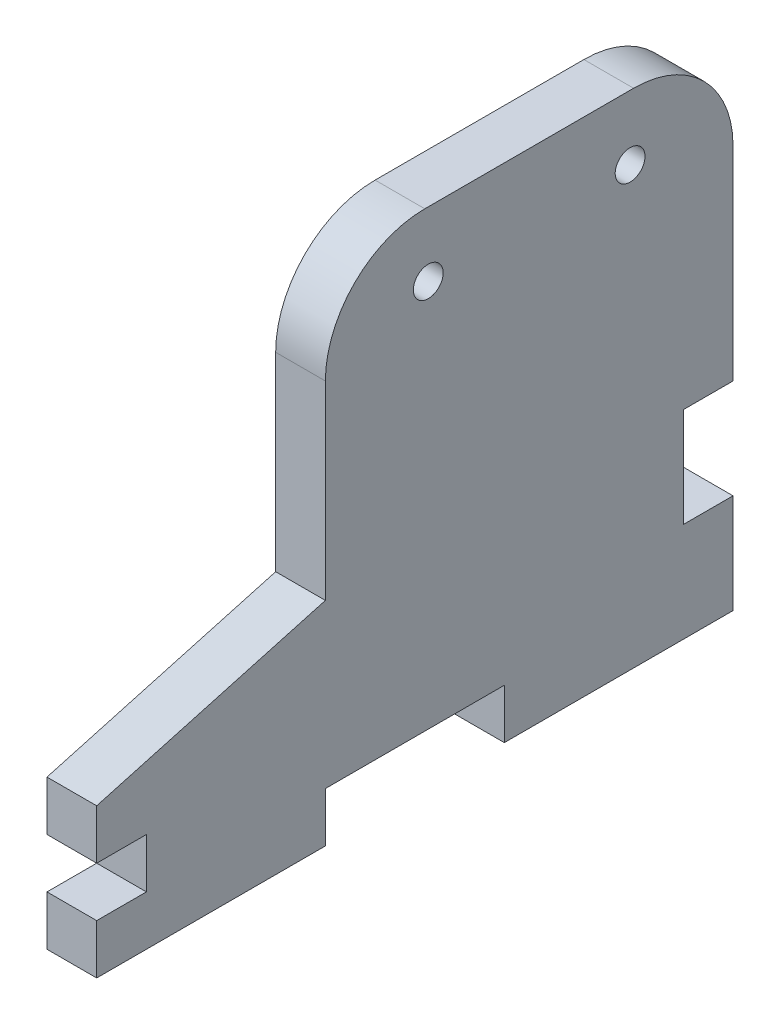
ISO-10303-21;
HEADER;
FILE_DESCRIPTION(('STEP AP214'),'2;1');
FILE_NAME('part.step','',(''),(''),'','','');
FILE_SCHEMA(('AUTOMOTIVE_DESIGN { 1 0 10303 214 1 1 1 1 }'));
ENDSEC;
DATA;
#1=APPLICATION_CONTEXT('core data for automotive mechanical design processes');
#2=APPLICATION_PROTOCOL_DEFINITION('international standard','automotive_design',2000,#1);
#3=PRODUCT_CONTEXT('',#1,'mechanical');
#4=PRODUCT('Part','Part','',(#3));
#5=PRODUCT_RELATED_PRODUCT_CATEGORY('part','',(#4));
#6=PRODUCT_DEFINITION_FORMATION('','',#4);
#7=PRODUCT_DEFINITION_CONTEXT('part definition',#1,'design');
#8=PRODUCT_DEFINITION('design','',#6,#7);
#9=PRODUCT_DEFINITION_SHAPE('','',#8);
#10=(LENGTH_UNIT() NAMED_UNIT(*) SI_UNIT(.MILLI.,.METRE.));
#11=(NAMED_UNIT(*) PLANE_ANGLE_UNIT() SI_UNIT($,.RADIAN.));
#12=(NAMED_UNIT(*) SI_UNIT($,.STERADIAN.) SOLID_ANGLE_UNIT());
#13=UNCERTAINTY_MEASURE_WITH_UNIT(LENGTH_MEASURE(1.E-05),#10,'distance_accuracy_value','');
#14=(GEOMETRIC_REPRESENTATION_CONTEXT(3) GLOBAL_UNCERTAINTY_ASSIGNED_CONTEXT((#13)) GLOBAL_UNIT_ASSIGNED_CONTEXT((#10,
#11,#12)) REPRESENTATION_CONTEXT('',''));
#15=CARTESIAN_POINT('',(0.,0.,0.));
#16=DIRECTION('',(0.,0.,1.));
#17=DIRECTION('',(1.,0.,0.));
#18=AXIS2_PLACEMENT_3D('',#15,#16,#17);
#19=CARTESIAN_POINT('',(5.,5.,19.6666666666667));
#20=DIRECTION('',(0.,0.,-1.));
#21=DIRECTION('',(0.,1.,0.));
#22=AXIS2_PLACEMENT_3D('',#19,#20,#21);
#23=PLANE('',#22);
#24=DIRECTION('',(0.,-1.,0.));
#25=VECTOR('',#24,1.);
#26=CARTESIAN_POINT('',(0.,5.,19.6666666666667));
#27=LINE('',#26,#25);
#28=CARTESIAN_POINT('',(0.,5.,19.6666666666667));
#29=VERTEX_POINT('',#28);
#30=CARTESIAN_POINT('',(0.,0.,19.6666666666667));
#31=VERTEX_POINT('',#30);
#32=EDGE_CURVE('E215',#29,#31,#27,.T.);
#33=ORIENTED_EDGE('',*,*,#32,.T.);
#34=DIRECTION('',(1.,0.,0.));
#35=VECTOR('',#34,1.);
#36=CARTESIAN_POINT('',(0.,0.,19.6666666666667));
#37=LINE('',#36,#35);
#38=CARTESIAN_POINT('',(5.,0.,19.6666666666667));
#39=VERTEX_POINT('',#38);
#40=EDGE_CURVE('E271',#31,#39,#37,.T.);
#41=ORIENTED_EDGE('',*,*,#40,.T.);
#42=DIRECTION('',(0.,-1.,0.));
#43=VECTOR('',#42,1.);
#44=CARTESIAN_POINT('',(5.,5.,19.6666666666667));
#45=LINE('',#44,#43);
#46=CARTESIAN_POINT('',(5.,5.,19.6666666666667));
#47=VERTEX_POINT('',#46);
#48=EDGE_CURVE('E198',#47,#39,#45,.T.);
#49=ORIENTED_EDGE('',*,*,#48,.F.);
#50=DIRECTION('',(-1.,0.,0.));
#51=VECTOR('',#50,1.);
#52=CARTESIAN_POINT('',(5.,5.,19.6666666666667));
#53=LINE('',#52,#51);
#54=EDGE_CURVE('E193',#47,#29,#53,.T.);
#55=ORIENTED_EDGE('',*,*,#54,.T.);
#56=EDGE_LOOP('',(#33,#41,#49,#55));
#57=FACE_BOUND('',#56,.T.);
#58=ADVANCED_FACE('F34',(#57),#23,.F.);
#59=CARTESIAN_POINT('',(5.,-10.,19.6666666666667));
#60=DIRECTION('',(0.,1.,0.));
#61=DIRECTION('',(0.,0.,1.));
#62=AXIS2_PLACEMENT_3D('',#59,#60,#61);
#63=PLANE('',#62);
#64=DIRECTION('',(0.,0.,-1.));
#65=VECTOR('',#64,1.);
#66=CARTESIAN_POINT('',(0.,-10.,19.6666666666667));
#67=LINE('',#66,#65);
#68=CARTESIAN_POINT('',(0.,-10.,19.6666666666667));
#69=VERTEX_POINT('',#68);
#70=CARTESIAN_POINT('',(0.,-10.,-3.33333333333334));
#71=VERTEX_POINT('',#70);
#72=EDGE_CURVE('E200',#69,#71,#67,.T.);
#73=ORIENTED_EDGE('',*,*,#72,.T.);
#74=DIRECTION('',(1.,0.,0.));
#75=VECTOR('',#74,1.);
#76=CARTESIAN_POINT('',(0.,-10.,-3.33333333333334));
#77=LINE('',#76,#75);
#78=CARTESIAN_POINT('',(5.,-10.,-3.33333333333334));
#79=VERTEX_POINT('',#78);
#80=EDGE_CURVE('E277',#71,#79,#77,.T.);
#81=ORIENTED_EDGE('',*,*,#80,.T.);
#82=DIRECTION('',(0.,0.,-1.));
#83=VECTOR('',#82,1.);
#84=CARTESIAN_POINT('',(5.,-10.,19.6666666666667));
#85=LINE('',#84,#83);
#86=CARTESIAN_POINT('',(5.,-10.,19.6666666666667));
#87=VERTEX_POINT('',#86);
#88=EDGE_CURVE('E205',#87,#79,#85,.T.);
#89=ORIENTED_EDGE('',*,*,#88,.F.);
#90=DIRECTION('',(-1.,0.,0.));
#91=VECTOR('',#90,1.);
#92=CARTESIAN_POINT('',(5.,-10.,19.6666666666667));
#93=LINE('',#92,#91);
#94=EDGE_CURVE('E208',#87,#69,#93,.T.);
#95=ORIENTED_EDGE('',*,*,#94,.T.);
#96=EDGE_LOOP('',(#73,#81,#89,#95));
#97=FACE_BOUND('',#96,.T.);
#98=ADVANCED_FACE('F379',(#97),#63,.F.);
#99=CARTESIAN_POINT('',(5.,20.,-39.3333333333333));
#100=DIRECTION('',(0.,0.,1.));
#101=DIRECTION('',(1.,0.,0.));
#102=AXIS2_PLACEMENT_3D('',#99,#100,#101);
#103=PLANE('',#102);
#104=DIRECTION('',(0.,1.,0.));
#105=VECTOR('',#104,1.);
#106=CARTESIAN_POINT('',(5.,20.,-39.3333333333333));
#107=LINE('',#106,#105);
#108=CARTESIAN_POINT('',(5.,0.,-39.3333333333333));
#109=VERTEX_POINT('',#108);
#110=CARTESIAN_POINT('',(5.,10.,-39.3333333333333));
#111=VERTEX_POINT('',#110);
#112=EDGE_CURVE('E196',#109,#111,#107,.T.);
#113=ORIENTED_EDGE('',*,*,#112,.F.);
#114=DIRECTION('',(1.,0.,0.));
#115=VECTOR('',#114,1.);
#116=CARTESIAN_POINT('',(-11.180339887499,0.,-39.3333333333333));
#117=LINE('',#116,#115);
#118=CARTESIAN_POINT('',(0.,0.,-39.3333333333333));
#119=VERTEX_POINT('',#118);
#120=EDGE_CURVE('E333',#119,#109,#117,.T.);
#121=ORIENTED_EDGE('',*,*,#120,.F.);
#122=DIRECTION('',(0.,1.,0.));
#123=VECTOR('',#122,1.);
#124=CARTESIAN_POINT('',(0.,20.,-39.3333333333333));
#125=LINE('',#124,#123);
#126=CARTESIAN_POINT('',(0.,10.,-39.3333333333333));
#127=VERTEX_POINT('',#126);
#128=EDGE_CURVE('E209',#119,#127,#125,.T.);
#129=ORIENTED_EDGE('',*,*,#128,.T.);
#130=DIRECTION('',(1.,0.,0.));
#131=VECTOR('',#130,1.);
#132=CARTESIAN_POINT('',(-11.180339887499,10.,-39.3333333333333));
#133=LINE('',#132,#131);
#134=EDGE_CURVE('E341',#127,#111,#133,.T.);
#135=ORIENTED_EDGE('',*,*,#134,.T.);
#136=EDGE_LOOP('',(#113,#121,#129,#135));
#137=FACE_BOUND('',#136,.T.);
#138=ADVANCED_FACE('F350',(#137),#103,.F.);
#139=CARTESIAN_POINT('',(5.,5.,19.6666666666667));
#140=DIRECTION('',(0.,-0.963517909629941,-0.267643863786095));
#141=DIRECTION('',(0.,0.267643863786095,-0.963517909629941));
#142=AXIS2_PLACEMENT_3D('',#139,#140,#141);
#143=PLANE('',#142);
#144=DIRECTION('',(0.,-0.267643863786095,0.963517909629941));
#145=VECTOR('',#144,1.);
#146=CARTESIAN_POINT('',(5.,5.,19.6666666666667));
#147=LINE('',#146,#145);
#148=CARTESIAN_POINT('',(5.,11.3888888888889,-3.33333333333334));
#149=VERTEX_POINT('',#148);
#150=EDGE_CURVE('E177',#149,#47,#147,.T.);
#151=ORIENTED_EDGE('',*,*,#150,.F.);
#152=DIRECTION('',(1.,0.,0.));
#153=VECTOR('',#152,1.);
#154=CARTESIAN_POINT('',(-50.2837626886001,11.3888888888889,-3.33333333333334));
#155=LINE('',#154,#153);
#156=CARTESIAN_POINT('',(0.,11.3888888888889,-3.33333333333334));
#157=VERTEX_POINT('',#156);
#158=EDGE_CURVE('E181',#157,#149,#155,.T.);
#159=ORIENTED_EDGE('',*,*,#158,.F.);
#160=DIRECTION('',(0.,-0.267643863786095,0.963517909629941));
#161=VECTOR('',#160,1.);
#162=CARTESIAN_POINT('',(0.,5.,19.6666666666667));
#163=LINE('',#162,#161);
#164=EDGE_CURVE('E211',#157,#29,#163,.T.);
#165=ORIENTED_EDGE('',*,*,#164,.T.);
#166=ORIENTED_EDGE('',*,*,#54,.F.);
#167=EDGE_LOOP('',(#151,#159,#165,#166));
#168=FACE_BOUND('',#167,.T.);
#169=ADVANCED_FACE('F191',(#168),#143,.F.);
#170=CARTESIAN_POINT('',(5.,-5.,19.6666666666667));
#171=VERTEX_POINT('',#170);
#172=EDGE_CURVE('E195',#171,#87,#45,.T.);
#173=ORIENTED_EDGE('',*,*,#172,.F.);
#174=DIRECTION('',(1.,0.,0.));
#175=VECTOR('',#174,1.);
#176=CARTESIAN_POINT('',(0.,-5.,19.6666666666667));
#177=LINE('',#176,#175);
#178=CARTESIAN_POINT('',(0.,-5.,19.6666666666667));
#179=VERTEX_POINT('',#178);
#180=EDGE_CURVE('E298',#179,#171,#177,.T.);
#181=ORIENTED_EDGE('',*,*,#180,.F.);
#182=EDGE_CURVE('E214',#179,#69,#27,.T.);
#183=ORIENTED_EDGE('',*,*,#182,.T.);
#184=ORIENTED_EDGE('',*,*,#94,.F.);
#185=EDGE_LOOP('',(#173,#181,#183,#184));
#186=FACE_BOUND('',#185,.T.);
#187=ADVANCED_FACE('F386',(#186),#23,.F.);
#188=CARTESIAN_POINT('',(5.,-10.,-21.3333333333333));
#189=VERTEX_POINT('',#188);
#190=CARTESIAN_POINT('',(5.,-10.,-44.3333333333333));
#191=VERTEX_POINT('',#190);
#192=EDGE_CURVE('E204',#189,#191,#85,.T.);
#193=ORIENTED_EDGE('',*,*,#192,.F.);
#194=DIRECTION('',(1.,0.,0.));
#195=VECTOR('',#194,1.);
#196=CARTESIAN_POINT('',(0.,-10.,-21.3333333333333));
#197=LINE('',#196,#195);
#198=CARTESIAN_POINT('',(0.,-10.,-21.3333333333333));
#199=VERTEX_POINT('',#198);
#200=EDGE_CURVE('E285',#199,#189,#197,.T.);
#201=ORIENTED_EDGE('',*,*,#200,.F.);
#202=CARTESIAN_POINT('',(0.,-10.,-44.3333333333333));
#203=VERTEX_POINT('',#202);
#204=EDGE_CURVE('E218',#199,#203,#67,.T.);
#205=ORIENTED_EDGE('',*,*,#204,.T.);
#206=DIRECTION('',(1.,0.,0.));
#207=VECTOR('',#206,1.);
#208=CARTESIAN_POINT('',(-11.180339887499,-10.,-44.3333333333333));
#209=LINE('',#208,#207);
#210=EDGE_CURVE('E324',#203,#191,#209,.T.);
#211=ORIENTED_EDGE('',*,*,#210,.T.);
#212=EDGE_LOOP('',(#193,#201,#205,#211));
#213=FACE_BOUND('',#212,.T.);
#214=ADVANCED_FACE('F364',(#213),#63,.F.);
#215=CARTESIAN_POINT('',(5.,0.,0.));
#216=DIRECTION('',(1.,0.,0.));
#217=DIRECTION('',(0.,0.,-1.));
#218=AXIS2_PLACEMENT_3D('',#215,#216,#217);
#219=PLANE('',#218);
#220=DIRECTION('',(0.,1.,0.));
#221=VECTOR('',#220,1.);
#222=CARTESIAN_POINT('',(5.,20.,-44.3333333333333));
#223=LINE('',#222,#221);
#224=CARTESIAN_POINT('',(5.,10.,-44.3333333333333));
#225=VERTEX_POINT('',#224);
#226=CARTESIAN_POINT('',(5.,30.5,-44.3333333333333));
#227=VERTEX_POINT('',#226);
#228=EDGE_CURVE('E253',#225,#227,#223,.T.);
#229=ORIENTED_EDGE('',*,*,#228,.T.);
#230=CARTESIAN_POINT('',(5.,30.5,-34.3333333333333));
#231=DIRECTION('',(1.,0.,0.));
#232=DIRECTION('',(0.,0.,-1.));
#233=AXIS2_PLACEMENT_3D('',#230,#231,#232);
#234=CIRCLE('',#233,10.);
#235=CARTESIAN_POINT('',(5.,40.5,-34.3333333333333));
#236=VERTEX_POINT('',#235);
#237=EDGE_CURVE('E228',#227,#236,#234,.T.);
#238=ORIENTED_EDGE('',*,*,#237,.T.);
#239=DIRECTION('',(0.,0.,1.));
#240=VECTOR('',#239,1.);
#241=CARTESIAN_POINT('',(5.,40.5,-3.33333333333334));
#242=LINE('',#241,#240);
#243=CARTESIAN_POINT('',(5.,40.5,-13.3333333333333));
#244=VERTEX_POINT('',#243);
#245=EDGE_CURVE('E182',#236,#244,#242,.T.);
#246=ORIENTED_EDGE('',*,*,#245,.T.);
#247=CARTESIAN_POINT('',(5.,30.5,-13.3333333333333));
#248=DIRECTION('',(1.,0.,0.));
#249=DIRECTION('',(0.,0.,-1.));
#250=AXIS2_PLACEMENT_3D('',#247,#248,#249);
#251=CIRCLE('',#250,10.);
#252=CARTESIAN_POINT('',(5.,30.5,-3.33333333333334));
#253=VERTEX_POINT('',#252);
#254=EDGE_CURVE('E180',#244,#253,#251,.T.);
#255=ORIENTED_EDGE('',*,*,#254,.T.);
#256=DIRECTION('',(0.,-1.,0.));
#257=VECTOR('',#256,1.);
#258=CARTESIAN_POINT('',(5.,11.3888888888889,-3.33333333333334));
#259=LINE('',#258,#257);
#260=EDGE_CURVE('E170',#253,#149,#259,.T.);
#261=ORIENTED_EDGE('',*,*,#260,.T.);
#262=ORIENTED_EDGE('',*,*,#150,.T.);
#263=ORIENTED_EDGE('',*,*,#48,.T.);
#264=DIRECTION('',(0.,0.,1.));
#265=VECTOR('',#264,1.);
#266=CARTESIAN_POINT('',(5.,0.,0.));
#267=LINE('',#266,#265);
#268=CARTESIAN_POINT('',(5.,0.,14.6666666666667));
#269=VERTEX_POINT('',#268);
#270=EDGE_CURVE('E311',#269,#39,#267,.T.);
#271=ORIENTED_EDGE('',*,*,#270,.F.);
#272=DIRECTION('',(0.,1.,0.));
#273=VECTOR('',#272,1.);
#274=CARTESIAN_POINT('',(5.,0.,14.6666666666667));
#275=LINE('',#274,#273);
#276=CARTESIAN_POINT('',(5.,-5.,14.6666666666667));
#277=VERTEX_POINT('',#276);
#278=EDGE_CURVE('E309',#277,#269,#275,.T.);
#279=ORIENTED_EDGE('',*,*,#278,.F.);
#280=DIRECTION('',(0.,0.,-1.));
#281=VECTOR('',#280,1.);
#282=CARTESIAN_POINT('',(5.,-5.,0.));
#283=LINE('',#282,#281);
#284=EDGE_CURVE('E281',#171,#277,#283,.T.);
#285=ORIENTED_EDGE('',*,*,#284,.F.);
#286=ORIENTED_EDGE('',*,*,#172,.T.);
#287=ORIENTED_EDGE('',*,*,#88,.T.);
#288=DIRECTION('',(0.,-1.,0.));
#289=VECTOR('',#288,1.);
#290=CARTESIAN_POINT('',(5.,0.,-3.33333333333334));
#291=LINE('',#290,#289);
#292=CARTESIAN_POINT('',(5.,-4.99999999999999,-3.33333333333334));
#293=VERTEX_POINT('',#292);
#294=EDGE_CURVE('E317',#293,#79,#291,.T.);
#295=ORIENTED_EDGE('',*,*,#294,.F.);
#296=DIRECTION('',(0.,0.,1.));
#297=VECTOR('',#296,1.);
#298=CARTESIAN_POINT('',(5.,-4.99999999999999,0.));
#299=LINE('',#298,#297);
#300=CARTESIAN_POINT('',(5.,-4.99999999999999,-21.3333333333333));
#301=VERTEX_POINT('',#300);
#302=EDGE_CURVE('E315',#301,#293,#299,.T.);
#303=ORIENTED_EDGE('',*,*,#302,.F.);
#304=DIRECTION('',(0.,1.,0.));
#305=VECTOR('',#304,1.);
#306=CARTESIAN_POINT('',(5.,0.,-21.3333333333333));
#307=LINE('',#306,#305);
#308=EDGE_CURVE('E313',#189,#301,#307,.T.);
#309=ORIENTED_EDGE('',*,*,#308,.F.);
#310=ORIENTED_EDGE('',*,*,#192,.T.);
#311=DIRECTION('',(0.,1.,0.));
#312=VECTOR('',#311,1.);
#313=CARTESIAN_POINT('',(5.,0.,-44.3333333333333));
#314=LINE('',#313,#312);
#315=CARTESIAN_POINT('',(5.,0.,-44.3333333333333));
#316=VERTEX_POINT('',#315);
#317=EDGE_CURVE('E319',#191,#316,#314,.T.);
#318=ORIENTED_EDGE('',*,*,#317,.T.);
#319=DIRECTION('',(0.,0.,1.));
#320=VECTOR('',#319,1.);
#321=CARTESIAN_POINT('',(5.,0.,-39.3333333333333));
#322=LINE('',#321,#320);
#323=EDGE_CURVE('E327',#316,#109,#322,.T.);
#324=ORIENTED_EDGE('',*,*,#323,.T.);
#325=ORIENTED_EDGE('',*,*,#112,.T.);
#326=DIRECTION('',(0.,0.,-1.));
#327=VECTOR('',#326,1.);
#328=CARTESIAN_POINT('',(5.,10.,-39.3333333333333));
#329=LINE('',#328,#327);
#330=EDGE_CURVE('E337',#111,#225,#329,.T.);
#331=ORIENTED_EDGE('',*,*,#330,.T.);
#332=EDGE_LOOP('',(#229,#238,#246,#255,#261,#262,#263,#271,#279,#285,#286,#287,#295,#303,#309,
#310,#318,#324,#325,#331));
#333=FACE_BOUND('',#332,.T.);
#334=CARTESIAN_POINT('',(5.,34.,-33.9833333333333));
#335=DIRECTION('',(1.,0.,0.));
#336=DIRECTION('',(0.,0.,-1.));
#337=AXIS2_PLACEMENT_3D('',#334,#335,#336);
#338=CIRCLE('',#337,1.5);
#339=CARTESIAN_POINT('',(5.,34.,-35.4833333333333));
#340=VERTEX_POINT('',#339);
#341=EDGE_CURVE('E259',#340,#340,#338,.T.);
#342=ORIENTED_EDGE('',*,*,#341,.F.);
#343=EDGE_LOOP('',(#342));
#344=FACE_BOUND('',#343,.T.);
#345=CARTESIAN_POINT('',(5.,34.,-13.6833333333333));
#346=DIRECTION('',(1.,0.,0.));
#347=DIRECTION('',(0.,0.,-1.));
#348=AXIS2_PLACEMENT_3D('',#345,#346,#347);
#349=CIRCLE('',#348,1.5);
#350=CARTESIAN_POINT('',(5.,34.,-15.1833333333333));
#351=VERTEX_POINT('',#350);
#352=EDGE_CURVE('E256',#351,#351,#349,.T.);
#353=ORIENTED_EDGE('',*,*,#352,.F.);
#354=EDGE_LOOP('',(#353));
#355=FACE_BOUND('',#354,.T.);
#356=ADVANCED_FACE('F173',(#333,#344,#355),#219,.T.);
#357=CARTESIAN_POINT('',(0.,0.,0.));
#358=DIRECTION('',(1.,0.,0.));
#359=DIRECTION('',(0.,0.,-1.));
#360=AXIS2_PLACEMENT_3D('',#357,#358,#359);
#361=PLANE('',#360);
#362=DIRECTION('',(0.,0.,-1.));
#363=VECTOR('',#362,1.);
#364=CARTESIAN_POINT('',(0.,40.5,-3.33333333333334));
#365=LINE('',#364,#363);
#366=CARTESIAN_POINT('',(0.,40.5,-13.3333333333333));
#367=VERTEX_POINT('',#366);
#368=CARTESIAN_POINT('',(0.,40.5,-34.3333333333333));
#369=VERTEX_POINT('',#368);
#370=EDGE_CURVE('E189',#367,#369,#365,.T.);
#371=ORIENTED_EDGE('',*,*,#370,.T.);
#372=CARTESIAN_POINT('',(0.,30.5,-34.3333333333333));
#373=DIRECTION('',(1.,0.,0.));
#374=DIRECTION('',(0.,0.,-1.));
#375=AXIS2_PLACEMENT_3D('',#372,#373,#374);
#376=CIRCLE('',#375,10.);
#377=CARTESIAN_POINT('',(0.,30.5,-44.3333333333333));
#378=VERTEX_POINT('',#377);
#379=EDGE_CURVE('E42',#369,#378,#376,.F.);
#380=ORIENTED_EDGE('',*,*,#379,.T.);
#381=DIRECTION('',(0.,-1.,0.));
#382=VECTOR('',#381,1.);
#383=CARTESIAN_POINT('',(0.,20.,-44.3333333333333));
#384=LINE('',#383,#382);
#385=CARTESIAN_POINT('',(0.,10.,-44.3333333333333));
#386=VERTEX_POINT('',#385);
#387=EDGE_CURVE('E241',#378,#386,#384,.T.);
#388=ORIENTED_EDGE('',*,*,#387,.T.);
#389=DIRECTION('',(0.,0.,1.));
#390=VECTOR('',#389,1.);
#391=CARTESIAN_POINT('',(0.,10.,-39.3333333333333));
#392=LINE('',#391,#390);
#393=EDGE_CURVE('E212',#386,#127,#392,.T.);
#394=ORIENTED_EDGE('',*,*,#393,.T.);
#395=ORIENTED_EDGE('',*,*,#128,.F.);
#396=DIRECTION('',(0.,0.,-1.));
#397=VECTOR('',#396,1.);
#398=CARTESIAN_POINT('',(0.,0.,-39.3333333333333));
#399=LINE('',#398,#397);
#400=CARTESIAN_POINT('',(0.,0.,-44.3333333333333));
#401=VERTEX_POINT('',#400);
#402=EDGE_CURVE('E323',#119,#401,#399,.T.);
#403=ORIENTED_EDGE('',*,*,#402,.T.);
#404=DIRECTION('',(0.,-1.,0.));
#405=VECTOR('',#404,1.);
#406=CARTESIAN_POINT('',(0.,0.,-44.3333333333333));
#407=LINE('',#406,#405);
#408=EDGE_CURVE('E320',#401,#203,#407,.T.);
#409=ORIENTED_EDGE('',*,*,#408,.T.);
#410=ORIENTED_EDGE('',*,*,#204,.F.);
#411=DIRECTION('',(0.,1.,0.));
#412=VECTOR('',#411,1.);
#413=CARTESIAN_POINT('',(0.,-10.,-21.3333333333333));
#414=LINE('',#413,#412);
#415=CARTESIAN_POINT('',(0.,-4.99999999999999,-21.3333333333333));
#416=VERTEX_POINT('',#415);
#417=EDGE_CURVE('E270',#199,#416,#414,.T.);
#418=ORIENTED_EDGE('',*,*,#417,.T.);
#419=DIRECTION('',(0.,0.,1.));
#420=VECTOR('',#419,1.);
#421=CARTESIAN_POINT('',(0.,-4.99999999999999,-3.33333333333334));
#422=LINE('',#421,#420);
#423=CARTESIAN_POINT('',(0.,-4.99999999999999,-3.33333333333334));
#424=VERTEX_POINT('',#423);
#425=EDGE_CURVE('E274',#416,#424,#422,.T.);
#426=ORIENTED_EDGE('',*,*,#425,.T.);
#427=DIRECTION('',(0.,-1.,0.));
#428=VECTOR('',#427,1.);
#429=CARTESIAN_POINT('',(0.,-10.,-3.33333333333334));
#430=LINE('',#429,#428);
#431=EDGE_CURVE('E267',#424,#71,#430,.T.);
#432=ORIENTED_EDGE('',*,*,#431,.T.);
#433=ORIENTED_EDGE('',*,*,#72,.F.);
#434=ORIENTED_EDGE('',*,*,#182,.F.);
#435=DIRECTION('',(0.,0.,-1.));
#436=VECTOR('',#435,1.);
#437=CARTESIAN_POINT('',(0.,-5.,19.6666666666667));
#438=LINE('',#437,#436);
#439=CARTESIAN_POINT('',(0.,-5.,14.6666666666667));
#440=VERTEX_POINT('',#439);
#441=EDGE_CURVE('E289',#179,#440,#438,.T.);
#442=ORIENTED_EDGE('',*,*,#441,.T.);
#443=DIRECTION('',(0.,1.,0.));
#444=VECTOR('',#443,1.);
#445=CARTESIAN_POINT('',(0.,-5.,14.6666666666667));
#446=LINE('',#445,#444);
#447=CARTESIAN_POINT('',(0.,0.,14.6666666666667));
#448=VERTEX_POINT('',#447);
#449=EDGE_CURVE('E292',#440,#448,#446,.T.);
#450=ORIENTED_EDGE('',*,*,#449,.T.);
#451=DIRECTION('',(0.,0.,1.));
#452=VECTOR('',#451,1.);
#453=CARTESIAN_POINT('',(0.,0.,19.6666666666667));
#454=LINE('',#453,#452);
#455=EDGE_CURVE('E295',#448,#31,#454,.T.);
#456=ORIENTED_EDGE('',*,*,#455,.T.);
#457=ORIENTED_EDGE('',*,*,#32,.F.);
#458=ORIENTED_EDGE('',*,*,#164,.F.);
#459=DIRECTION('',(0.,1.,0.));
#460=VECTOR('',#459,1.);
#461=CARTESIAN_POINT('',(0.,11.3888888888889,-3.33333333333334));
#462=LINE('',#461,#460);
#463=CARTESIAN_POINT('',(0.,30.5,-3.33333333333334));
#464=VERTEX_POINT('',#463);
#465=EDGE_CURVE('E186',#157,#464,#462,.T.);
#466=ORIENTED_EDGE('',*,*,#465,.T.);
#467=CARTESIAN_POINT('',(0.,30.5,-13.3333333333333));
#468=DIRECTION('',(1.,0.,0.));
#469=DIRECTION('',(0.,0.,-1.));
#470=AXIS2_PLACEMENT_3D('',#467,#468,#469);
#471=CIRCLE('',#470,10.);
#472=EDGE_CURVE('E234',#464,#367,#471,.F.);
#473=ORIENTED_EDGE('',*,*,#472,.T.);
#474=EDGE_LOOP('',(#371,#380,#388,#394,#395,#403,#409,#410,#418,#426,#432,#433,#434,#442,#450,
#456,#457,#458,#466,#473));
#475=FACE_BOUND('',#474,.T.);
#476=CARTESIAN_POINT('',(0.,34.,-33.9833333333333));
#477=DIRECTION('',(1.,0.,0.));
#478=DIRECTION('',(0.,0.,-1.));
#479=AXIS2_PLACEMENT_3D('',#476,#477,#478);
#480=CIRCLE('',#479,1.5);
#481=CARTESIAN_POINT('',(0.,34.,-35.4833333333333));
#482=VERTEX_POINT('',#481);
#483=EDGE_CURVE('E263',#482,#482,#480,.F.);
#484=ORIENTED_EDGE('',*,*,#483,.F.);
#485=EDGE_LOOP('',(#484));
#486=FACE_BOUND('',#485,.T.);
#487=CARTESIAN_POINT('',(0.,34.,-13.6833333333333));
#488=DIRECTION('',(1.,0.,0.));
#489=DIRECTION('',(0.,0.,-1.));
#490=AXIS2_PLACEMENT_3D('',#487,#488,#489);
#491=CIRCLE('',#490,1.5);
#492=CARTESIAN_POINT('',(0.,34.,-15.1833333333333));
#493=VERTEX_POINT('',#492);
#494=EDGE_CURVE('E266',#493,#493,#491,.F.);
#495=ORIENTED_EDGE('',*,*,#494,.F.);
#496=EDGE_LOOP('',(#495));
#497=FACE_BOUND('',#496,.T.);
#498=ADVANCED_FACE('F238',(#475,#486,#497),#361,.F.);
#499=CARTESIAN_POINT('',(-11.180339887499,20.,-44.3333333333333));
#500=DIRECTION('',(0.,0.,-1.));
#501=DIRECTION('',(-1.,0.,0.));
#502=AXIS2_PLACEMENT_3D('',#499,#500,#501);
#503=PLANE('',#502);
#504=ORIENTED_EDGE('',*,*,#387,.F.);
#505=DIRECTION('',(1.,0.,0.));
#506=VECTOR('',#505,1.);
#507=CARTESIAN_POINT('',(-11.180339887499,30.5,-44.3333333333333));
#508=LINE('',#507,#506);
#509=EDGE_CURVE('E224',#378,#227,#508,.T.);
#510=ORIENTED_EDGE('',*,*,#509,.T.);
#511=ORIENTED_EDGE('',*,*,#228,.F.);
#512=DIRECTION('',(1.,0.,0.));
#513=VECTOR('',#512,1.);
#514=CARTESIAN_POINT('',(-11.180339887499,10.,-44.3333333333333));
#515=LINE('',#514,#513);
#516=EDGE_CURVE('E248',#386,#225,#515,.T.);
#517=ORIENTED_EDGE('',*,*,#516,.F.);
#518=EDGE_LOOP('',(#504,#510,#511,#517));
#519=FACE_BOUND('',#518,.T.);
#520=ADVANCED_FACE('F246',(#519),#503,.T.);
#521=CARTESIAN_POINT('',(-11.180339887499,10.,-39.3333333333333));
#522=DIRECTION('',(0.,-1.,0.));
#523=DIRECTION('',(0.,0.,-1.));
#524=AXIS2_PLACEMENT_3D('',#521,#522,#523);
#525=PLANE('',#524);
#526=ORIENTED_EDGE('',*,*,#393,.F.);
#527=ORIENTED_EDGE('',*,*,#516,.T.);
#528=ORIENTED_EDGE('',*,*,#330,.F.);
#529=ORIENTED_EDGE('',*,*,#134,.F.);
#530=EDGE_LOOP('',(#526,#527,#528,#529));
#531=FACE_BOUND('',#530,.T.);
#532=ADVANCED_FACE('F348',(#531),#525,.T.);
#533=CARTESIAN_POINT('',(-11.180339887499,0.,-44.3333333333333));
#534=DIRECTION('',(0.,0.,-1.));
#535=DIRECTION('',(-1.,0.,0.));
#536=AXIS2_PLACEMENT_3D('',#533,#534,#535);
#537=PLANE('',#536);
#538=ORIENTED_EDGE('',*,*,#408,.F.);
#539=DIRECTION('',(1.,0.,0.));
#540=VECTOR('',#539,1.);
#541=CARTESIAN_POINT('',(-11.180339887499,0.,-44.3333333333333));
#542=LINE('',#541,#540);
#543=EDGE_CURVE('E330',#401,#316,#542,.T.);
#544=ORIENTED_EDGE('',*,*,#543,.T.);
#545=ORIENTED_EDGE('',*,*,#317,.F.);
#546=ORIENTED_EDGE('',*,*,#210,.F.);
#547=EDGE_LOOP('',(#538,#544,#545,#546));
#548=FACE_BOUND('',#547,.T.);
#549=ADVANCED_FACE('F360',(#548),#537,.T.);
#550=CARTESIAN_POINT('',(-11.180339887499,0.,-39.3333333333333));
#551=DIRECTION('',(0.,1.,0.));
#552=DIRECTION('',(0.,0.,1.));
#553=AXIS2_PLACEMENT_3D('',#550,#551,#552);
#554=PLANE('',#553);
#555=ORIENTED_EDGE('',*,*,#402,.F.);
#556=ORIENTED_EDGE('',*,*,#120,.T.);
#557=ORIENTED_EDGE('',*,*,#323,.F.);
#558=ORIENTED_EDGE('',*,*,#543,.F.);
#559=EDGE_LOOP('',(#555,#556,#557,#558));
#560=FACE_BOUND('',#559,.T.);
#561=ADVANCED_FACE('F355',(#560),#554,.T.);
#562=CARTESIAN_POINT('',(0.,0.,19.6666666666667));
#563=DIRECTION('',(0.,1.,0.));
#564=DIRECTION('',(0.,0.,1.));
#565=AXIS2_PLACEMENT_3D('',#562,#563,#564);
#566=PLANE('',#565);
#567=ORIENTED_EDGE('',*,*,#270,.T.);
#568=ORIENTED_EDGE('',*,*,#40,.F.);
#569=ORIENTED_EDGE('',*,*,#455,.F.);
#570=DIRECTION('',(1.,0.,0.));
#571=VECTOR('',#570,1.);
#572=CARTESIAN_POINT('',(0.,0.,14.6666666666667));
#573=LINE('',#572,#571);
#574=EDGE_CURVE('E301',#448,#269,#573,.T.);
#575=ORIENTED_EDGE('',*,*,#574,.T.);
#576=EDGE_LOOP('',(#567,#568,#569,#575));
#577=FACE_BOUND('',#576,.T.);
#578=ADVANCED_FACE('F397',(#577),#566,.F.);
#579=CARTESIAN_POINT('',(0.,-5.,14.6666666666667));
#580=DIRECTION('',(0.,0.,-1.));
#581=DIRECTION('',(-1.,0.,0.));
#582=AXIS2_PLACEMENT_3D('',#579,#580,#581);
#583=PLANE('',#582);
#584=ORIENTED_EDGE('',*,*,#278,.T.);
#585=ORIENTED_EDGE('',*,*,#574,.F.);
#586=ORIENTED_EDGE('',*,*,#449,.F.);
#587=DIRECTION('',(1.,0.,0.));
#588=VECTOR('',#587,1.);
#589=CARTESIAN_POINT('',(0.,-5.,14.6666666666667));
#590=LINE('',#589,#588);
#591=EDGE_CURVE('E304',#440,#277,#590,.T.);
#592=ORIENTED_EDGE('',*,*,#591,.T.);
#593=EDGE_LOOP('',(#584,#585,#586,#592));
#594=FACE_BOUND('',#593,.T.);
#595=ADVANCED_FACE('F394',(#594),#583,.F.);
#596=CARTESIAN_POINT('',(0.,-5.,19.6666666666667));
#597=DIRECTION('',(0.,-1.,0.));
#598=DIRECTION('',(0.,0.,-1.));
#599=AXIS2_PLACEMENT_3D('',#596,#597,#598);
#600=PLANE('',#599);
#601=ORIENTED_EDGE('',*,*,#284,.T.);
#602=ORIENTED_EDGE('',*,*,#591,.F.);
#603=ORIENTED_EDGE('',*,*,#441,.F.);
#604=ORIENTED_EDGE('',*,*,#180,.T.);
#605=EDGE_LOOP('',(#601,#602,#603,#604));
#606=FACE_BOUND('',#605,.T.);
#607=ADVANCED_FACE('F389',(#606),#600,.F.);
#608=CARTESIAN_POINT('',(0.,-10.,-3.33333333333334));
#609=DIRECTION('',(0.,0.,1.));
#610=DIRECTION('',(1.,0.,0.));
#611=AXIS2_PLACEMENT_3D('',#608,#609,#610);
#612=PLANE('',#611);
#613=ORIENTED_EDGE('',*,*,#294,.T.);
#614=ORIENTED_EDGE('',*,*,#80,.F.);
#615=ORIENTED_EDGE('',*,*,#431,.F.);
#616=DIRECTION('',(1.,0.,0.));
#617=VECTOR('',#616,1.);
#618=CARTESIAN_POINT('',(0.,-4.99999999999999,-3.33333333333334));
#619=LINE('',#618,#617);
#620=EDGE_CURVE('E278',#424,#293,#619,.T.);
#621=ORIENTED_EDGE('',*,*,#620,.T.);
#622=EDGE_LOOP('',(#613,#614,#615,#621));
#623=FACE_BOUND('',#622,.T.);
#624=ADVANCED_FACE('F376',(#623),#612,.F.);
#625=CARTESIAN_POINT('',(0.,-4.99999999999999,-3.33333333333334));
#626=DIRECTION('',(0.,1.,0.));
#627=DIRECTION('',(0.,0.,1.));
#628=AXIS2_PLACEMENT_3D('',#625,#626,#627);
#629=PLANE('',#628);
#630=ORIENTED_EDGE('',*,*,#302,.T.);
#631=ORIENTED_EDGE('',*,*,#620,.F.);
#632=ORIENTED_EDGE('',*,*,#425,.F.);
#633=DIRECTION('',(1.,0.,0.));
#634=VECTOR('',#633,1.);
#635=CARTESIAN_POINT('',(0.,-4.99999999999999,-21.3333333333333));
#636=LINE('',#635,#634);
#637=EDGE_CURVE('E282',#416,#301,#636,.T.);
#638=ORIENTED_EDGE('',*,*,#637,.T.);
#639=EDGE_LOOP('',(#630,#631,#632,#638));
#640=FACE_BOUND('',#639,.T.);
#641=ADVANCED_FACE('F372',(#640),#629,.F.);
#642=CARTESIAN_POINT('',(0.,-10.,-21.3333333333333));
#643=DIRECTION('',(0.,0.,-1.));
#644=DIRECTION('',(-1.,0.,0.));
#645=AXIS2_PLACEMENT_3D('',#642,#643,#644);
#646=PLANE('',#645);
#647=ORIENTED_EDGE('',*,*,#308,.T.);
#648=ORIENTED_EDGE('',*,*,#637,.F.);
#649=ORIENTED_EDGE('',*,*,#417,.F.);
#650=ORIENTED_EDGE('',*,*,#200,.T.);
#651=EDGE_LOOP('',(#647,#648,#649,#650));
#652=FACE_BOUND('',#651,.T.);
#653=ADVANCED_FACE('F368',(#652),#646,.F.);
#654=CARTESIAN_POINT('',(-50.2837626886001,40.5,-3.33333333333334));
#655=DIRECTION('',(0.,1.,0.));
#656=DIRECTION('',(0.,0.,1.));
#657=AXIS2_PLACEMENT_3D('',#654,#655,#656);
#658=PLANE('',#657);
#659=ORIENTED_EDGE('',*,*,#245,.F.);
#660=DIRECTION('',(1.,0.,0.));
#661=VECTOR('',#660,1.);
#662=CARTESIAN_POINT('',(-50.2837626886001,40.5,-34.3333333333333));
#663=LINE('',#662,#661);
#664=EDGE_CURVE('E55',#236,#369,#663,.F.);
#665=ORIENTED_EDGE('',*,*,#664,.T.);
#666=ORIENTED_EDGE('',*,*,#370,.F.);
#667=DIRECTION('',(1.,0.,0.));
#668=VECTOR('',#667,1.);
#669=CARTESIAN_POINT('',(-50.2837626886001,40.5,-13.3333333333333));
#670=LINE('',#669,#668);
#671=EDGE_CURVE('E230',#367,#244,#670,.T.);
#672=ORIENTED_EDGE('',*,*,#671,.T.);
#673=EDGE_LOOP('',(#659,#665,#666,#672));
#674=FACE_BOUND('',#673,.T.);
#675=ADVANCED_FACE('F254',(#674),#658,.T.);
#676=CARTESIAN_POINT('',(-50.2837626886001,11.3888888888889,-3.33333333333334));
#677=DIRECTION('',(0.,0.,1.));
#678=DIRECTION('',(1.,0.,0.));
#679=AXIS2_PLACEMENT_3D('',#676,#677,#678);
#680=PLANE('',#679);
#681=ORIENTED_EDGE('',*,*,#260,.F.);
#682=DIRECTION('',(1.,0.,0.));
#683=VECTOR('',#682,1.);
#684=CARTESIAN_POINT('',(-50.2837626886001,30.5,-3.33333333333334));
#685=LINE('',#684,#683);
#686=EDGE_CURVE('E11',#253,#464,#685,.F.);
#687=ORIENTED_EDGE('',*,*,#686,.T.);
#688=ORIENTED_EDGE('',*,*,#465,.F.);
#689=ORIENTED_EDGE('',*,*,#158,.T.);
#690=EDGE_LOOP('',(#681,#687,#688,#689));
#691=FACE_BOUND('',#690,.T.);
#692=ADVANCED_FACE('F185',(#691),#680,.T.);
#693=CARTESIAN_POINT('',(-50.2837626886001,34.,-13.6833333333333));
#694=DIRECTION('',(1.,0.,0.));
#695=DIRECTION('',(0.,0.,-1.));
#696=AXIS2_PLACEMENT_3D('',#693,#694,#695);
#697=CYLINDRICAL_SURFACE('',#696,1.5);
#698=CARTESIAN_POINT('',(0.,34.,-15.1833333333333));
#699=CARTESIAN_POINT('',(0.0520833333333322,34.,-15.1833333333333));
#700=CARTESIAN_POINT('',(0.104166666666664,34.,-15.1833333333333));
#701=CARTESIAN_POINT('',(0.208333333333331,34.,-15.1833333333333));
#702=CARTESIAN_POINT('',(0.260416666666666,34.,-15.1833333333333));
#703=CARTESIAN_POINT('',(0.364583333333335,34.,-15.1833333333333));
#704=CARTESIAN_POINT('',(0.416666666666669,34.,-15.1833333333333));
#705=CARTESIAN_POINT('',(0.520833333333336,34.,-15.1833333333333));
#706=CARTESIAN_POINT('',(0.572916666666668,34.,-15.1833333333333));
#707=CARTESIAN_POINT('',(0.677083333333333,34.,-15.1833333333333));
#708=CARTESIAN_POINT('',(0.729166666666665,34.,-15.1833333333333));
#709=CARTESIAN_POINT('',(0.833333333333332,34.,-15.1833333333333));
#710=CARTESIAN_POINT('',(0.885416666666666,34.,-15.1833333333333));
#711=CARTESIAN_POINT('',(0.989583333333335,34.,-15.1833333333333));
#712=CARTESIAN_POINT('',(1.04166666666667,34.,-15.1833333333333));
#713=CARTESIAN_POINT('',(1.14583333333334,34.,-15.1833333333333));
#714=CARTESIAN_POINT('',(1.19791666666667,34.,-15.1833333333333));
#715=CARTESIAN_POINT('',(1.30208333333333,34.,-15.1833333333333));
#716=CARTESIAN_POINT('',(1.35416666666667,34.,-15.1833333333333));
#717=CARTESIAN_POINT('',(1.45833333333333,34.,-15.1833333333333));
#718=CARTESIAN_POINT('',(1.51041666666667,34.,-15.1833333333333));
#719=CARTESIAN_POINT('',(1.61458333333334,34.,-15.1833333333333));
#720=CARTESIAN_POINT('',(1.66666666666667,34.,-15.1833333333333));
#721=CARTESIAN_POINT('',(1.77083333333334,34.,-15.1833333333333));
#722=CARTESIAN_POINT('',(1.82291666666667,34.,-15.1833333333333));
#723=CARTESIAN_POINT('',(1.92708333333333,34.,-15.1833333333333));
#724=CARTESIAN_POINT('',(1.97916666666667,34.,-15.1833333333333));
#725=CARTESIAN_POINT('',(2.08333333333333,34.,-15.1833333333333));
#726=CARTESIAN_POINT('',(2.13541666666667,34.,-15.1833333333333));
#727=CARTESIAN_POINT('',(2.23958333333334,34.,-15.1833333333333));
#728=CARTESIAN_POINT('',(2.29166666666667,34.,-15.1833333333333));
#729=CARTESIAN_POINT('',(2.39583333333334,34.,-15.1833333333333));
#730=CARTESIAN_POINT('',(2.44791666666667,34.,-15.1833333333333));
#731=CARTESIAN_POINT('',(2.55208333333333,34.,-15.1833333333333));
#732=CARTESIAN_POINT('',(2.60416666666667,34.,-15.1833333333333));
#733=CARTESIAN_POINT('',(2.70833333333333,34.,-15.1833333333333));
#734=CARTESIAN_POINT('',(2.76041666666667,34.,-15.1833333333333));
#735=CARTESIAN_POINT('',(2.86458333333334,34.,-15.1833333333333));
#736=CARTESIAN_POINT('',(2.91666666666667,34.,-15.1833333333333));
#737=CARTESIAN_POINT('',(3.02083333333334,34.,-15.1833333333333));
#738=CARTESIAN_POINT('',(3.07291666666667,34.,-15.1833333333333));
#739=CARTESIAN_POINT('',(3.17708333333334,34.,-15.1833333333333));
#740=CARTESIAN_POINT('',(3.22916666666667,34.,-15.1833333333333));
#741=CARTESIAN_POINT('',(3.33333333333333,34.,-15.1833333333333));
#742=CARTESIAN_POINT('',(3.38541666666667,34.,-15.1833333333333));
#743=CARTESIAN_POINT('',(3.48958333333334,34.,-15.1833333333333));
#744=CARTESIAN_POINT('',(3.54166666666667,34.,-15.1833333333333));
#745=CARTESIAN_POINT('',(3.64583333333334,34.,-15.1833333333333));
#746=CARTESIAN_POINT('',(3.69791666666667,34.,-15.1833333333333));
#747=CARTESIAN_POINT('',(3.80208333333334,34.,-15.1833333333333));
#748=CARTESIAN_POINT('',(3.85416666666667,34.,-15.1833333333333));
#749=CARTESIAN_POINT('',(3.95833333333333,34.,-15.1833333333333));
#750=CARTESIAN_POINT('',(4.01041666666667,34.,-15.1833333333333));
#751=CARTESIAN_POINT('',(4.11458333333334,34.,-15.1833333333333));
#752=CARTESIAN_POINT('',(4.16666666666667,34.,-15.1833333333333));
#753=CARTESIAN_POINT('',(4.27083333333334,34.,-15.1833333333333));
#754=CARTESIAN_POINT('',(4.32291666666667,34.,-15.1833333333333));
#755=CARTESIAN_POINT('',(4.42708333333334,34.,-15.1833333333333));
#756=CARTESIAN_POINT('',(4.47916666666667,34.,-15.1833333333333));
#757=CARTESIAN_POINT('',(4.58333333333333,34.,-15.1833333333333));
#758=CARTESIAN_POINT('',(4.63541666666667,34.,-15.1833333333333));
#759=CARTESIAN_POINT('',(4.73958333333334,34.,-15.1833333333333));
#760=CARTESIAN_POINT('',(4.79166666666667,34.,-15.1833333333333));
#761=CARTESIAN_POINT('',(4.89583333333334,34.,-15.1833333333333));
#762=CARTESIAN_POINT('',(4.94791666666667,34.,-15.1833333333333));
#763=CARTESIAN_POINT('',(5.,34.,-15.1833333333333));
#764=B_SPLINE_CURVE_WITH_KNOTS('',3,(#698,#699,#700,#701,#702,#703,#704,#705,#706,#707,#708,
#709,#710,#711,#712,#713,#714,#715,#716,#717,#718,#719,#720,#721,#722,#723,#724,#725,#726,#727,
#728,#729,#730,#731,#732,#733,#734,#735,#736,#737,#738,#739,#740,#741,#742,#743,#744,#745,#746,
#747,#748,#749,#750,#751,#752,#753,#754,#755,#756,#757,#758,#759,#760,#761,#762,#763),
.UNSPECIFIED.,.F.,.F.,(4,2,2,2,2,2,2,2,2,2,2,2,2,2,2,2,2,2,2,2,2,2,2,2,2,2,2,2,2,2,2,2,4),(0.,
0.156249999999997,0.3125,0.468750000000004,0.625000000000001,0.781249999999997,
0.937500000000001,1.09375,1.25,1.40625,1.5625,1.71875,1.875,2.03125,2.1875,2.34375000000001,2.5,
2.65625,2.8125,2.96875000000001,3.125,3.28125,3.4375,3.59375000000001,3.75,3.90625,4.0625,
4.21875000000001,4.375,4.53125,4.6875,4.84375000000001,5.),.UNSPECIFIED.);
#765=EDGE_CURVE('BSEAM423',#493,#351,#764,.T.);
#766=ORIENTED_EDGE('',*,*,#494,.T.);
#767=ORIENTED_EDGE('',*,*,#352,.T.);
#768=ORIENTED_EDGE('',*,*,#765,.T.);
#769=ORIENTED_EDGE('',*,*,#765,.F.);
#770=EDGE_LOOP('',(#766,#768,#767,#769));
#771=FACE_BOUND('',#770,.T.);
#772=ADVANCED_FACE('F423',(#771),#697,.F.);
#773=CARTESIAN_POINT('',(-50.2837626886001,34.,-33.9833333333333));
#774=DIRECTION('',(1.,0.,0.));
#775=DIRECTION('',(0.,0.,-1.));
#776=AXIS2_PLACEMENT_3D('',#773,#774,#775);
#777=CYLINDRICAL_SURFACE('',#776,1.5);
#778=CARTESIAN_POINT('',(0.,34.,-35.4833333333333));
#779=CARTESIAN_POINT('',(0.0520833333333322,34.,-35.4833333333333));
#780=CARTESIAN_POINT('',(0.104166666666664,34.,-35.4833333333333));
#781=CARTESIAN_POINT('',(0.208333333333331,34.,-35.4833333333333));
#782=CARTESIAN_POINT('',(0.260416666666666,34.,-35.4833333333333));
#783=CARTESIAN_POINT('',(0.364583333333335,34.,-35.4833333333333));
#784=CARTESIAN_POINT('',(0.416666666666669,34.,-35.4833333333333));
#785=CARTESIAN_POINT('',(0.520833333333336,34.,-35.4833333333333));
#786=CARTESIAN_POINT('',(0.572916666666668,34.,-35.4833333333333));
#787=CARTESIAN_POINT('',(0.677083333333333,34.,-35.4833333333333));
#788=CARTESIAN_POINT('',(0.729166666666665,34.,-35.4833333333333));
#789=CARTESIAN_POINT('',(0.833333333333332,34.,-35.4833333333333));
#790=CARTESIAN_POINT('',(0.885416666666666,34.,-35.4833333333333));
#791=CARTESIAN_POINT('',(0.989583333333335,34.,-35.4833333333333));
#792=CARTESIAN_POINT('',(1.04166666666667,34.,-35.4833333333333));
#793=CARTESIAN_POINT('',(1.14583333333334,34.,-35.4833333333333));
#794=CARTESIAN_POINT('',(1.19791666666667,34.,-35.4833333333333));
#795=CARTESIAN_POINT('',(1.30208333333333,34.,-35.4833333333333));
#796=CARTESIAN_POINT('',(1.35416666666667,34.,-35.4833333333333));
#797=CARTESIAN_POINT('',(1.45833333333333,34.,-35.4833333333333));
#798=CARTESIAN_POINT('',(1.51041666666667,34.,-35.4833333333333));
#799=CARTESIAN_POINT('',(1.61458333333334,34.,-35.4833333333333));
#800=CARTESIAN_POINT('',(1.66666666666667,34.,-35.4833333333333));
#801=CARTESIAN_POINT('',(1.77083333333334,34.,-35.4833333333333));
#802=CARTESIAN_POINT('',(1.82291666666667,34.,-35.4833333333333));
#803=CARTESIAN_POINT('',(1.92708333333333,34.,-35.4833333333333));
#804=CARTESIAN_POINT('',(1.97916666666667,34.,-35.4833333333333));
#805=CARTESIAN_POINT('',(2.08333333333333,34.,-35.4833333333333));
#806=CARTESIAN_POINT('',(2.13541666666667,34.,-35.4833333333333));
#807=CARTESIAN_POINT('',(2.23958333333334,34.,-35.4833333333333));
#808=CARTESIAN_POINT('',(2.29166666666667,34.,-35.4833333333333));
#809=CARTESIAN_POINT('',(2.39583333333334,34.,-35.4833333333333));
#810=CARTESIAN_POINT('',(2.44791666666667,34.,-35.4833333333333));
#811=CARTESIAN_POINT('',(2.55208333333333,34.,-35.4833333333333));
#812=CARTESIAN_POINT('',(2.60416666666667,34.,-35.4833333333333));
#813=CARTESIAN_POINT('',(2.70833333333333,34.,-35.4833333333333));
#814=CARTESIAN_POINT('',(2.76041666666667,34.,-35.4833333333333));
#815=CARTESIAN_POINT('',(2.86458333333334,34.,-35.4833333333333));
#816=CARTESIAN_POINT('',(2.91666666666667,34.,-35.4833333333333));
#817=CARTESIAN_POINT('',(3.02083333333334,34.,-35.4833333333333));
#818=CARTESIAN_POINT('',(3.07291666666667,34.,-35.4833333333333));
#819=CARTESIAN_POINT('',(3.17708333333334,34.,-35.4833333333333));
#820=CARTESIAN_POINT('',(3.22916666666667,34.,-35.4833333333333));
#821=CARTESIAN_POINT('',(3.33333333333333,34.,-35.4833333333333));
#822=CARTESIAN_POINT('',(3.38541666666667,34.,-35.4833333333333));
#823=CARTESIAN_POINT('',(3.48958333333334,34.,-35.4833333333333));
#824=CARTESIAN_POINT('',(3.54166666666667,34.,-35.4833333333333));
#825=CARTESIAN_POINT('',(3.64583333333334,34.,-35.4833333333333));
#826=CARTESIAN_POINT('',(3.69791666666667,34.,-35.4833333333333));
#827=CARTESIAN_POINT('',(3.80208333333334,34.,-35.4833333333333));
#828=CARTESIAN_POINT('',(3.85416666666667,34.,-35.4833333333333));
#829=CARTESIAN_POINT('',(3.95833333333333,34.,-35.4833333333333));
#830=CARTESIAN_POINT('',(4.01041666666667,34.,-35.4833333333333));
#831=CARTESIAN_POINT('',(4.11458333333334,34.,-35.4833333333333));
#832=CARTESIAN_POINT('',(4.16666666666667,34.,-35.4833333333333));
#833=CARTESIAN_POINT('',(4.27083333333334,34.,-35.4833333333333));
#834=CARTESIAN_POINT('',(4.32291666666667,34.,-35.4833333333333));
#835=CARTESIAN_POINT('',(4.42708333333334,34.,-35.4833333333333));
#836=CARTESIAN_POINT('',(4.47916666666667,34.,-35.4833333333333));
#837=CARTESIAN_POINT('',(4.58333333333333,34.,-35.4833333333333));
#838=CARTESIAN_POINT('',(4.63541666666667,34.,-35.4833333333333));
#839=CARTESIAN_POINT('',(4.73958333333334,34.,-35.4833333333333));
#840=CARTESIAN_POINT('',(4.79166666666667,34.,-35.4833333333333));
#841=CARTESIAN_POINT('',(4.89583333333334,34.,-35.4833333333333));
#842=CARTESIAN_POINT('',(4.94791666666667,34.,-35.4833333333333));
#843=CARTESIAN_POINT('',(5.,34.,-35.4833333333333));
#844=B_SPLINE_CURVE_WITH_KNOTS('',3,(#778,#779,#780,#781,#782,#783,#784,#785,#786,#787,#788,
#789,#790,#791,#792,#793,#794,#795,#796,#797,#798,#799,#800,#801,#802,#803,#804,#805,#806,#807,
#808,#809,#810,#811,#812,#813,#814,#815,#816,#817,#818,#819,#820,#821,#822,#823,#824,#825,#826,
#827,#828,#829,#830,#831,#832,#833,#834,#835,#836,#837,#838,#839,#840,#841,#842,#843),
.UNSPECIFIED.,.F.,.F.,(4,2,2,2,2,2,2,2,2,2,2,2,2,2,2,2,2,2,2,2,2,2,2,2,2,2,2,2,2,2,2,2,4),(0.,
0.156249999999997,0.3125,0.468750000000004,0.625000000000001,0.781249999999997,
0.937500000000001,1.09375,1.25,1.40625,1.5625,1.71875,1.875,2.03125,2.1875,2.34375000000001,2.5,
2.65625,2.8125,2.96875000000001,3.125,3.28125,3.4375,3.59375000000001,3.75,3.90625,4.0625,
4.21875000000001,4.375,4.53125,4.6875,4.84375000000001,5.),.UNSPECIFIED.);
#845=EDGE_CURVE('BSEAM417',#482,#340,#844,.T.);
#846=ORIENTED_EDGE('',*,*,#483,.T.);
#847=ORIENTED_EDGE('',*,*,#341,.T.);
#848=ORIENTED_EDGE('',*,*,#845,.T.);
#849=ORIENTED_EDGE('',*,*,#845,.F.);
#850=EDGE_LOOP('',(#846,#848,#847,#849));
#851=FACE_BOUND('',#850,.T.);
#852=ADVANCED_FACE('F417',(#851),#777,.F.);
#853=CARTESIAN_POINT('',(-11.180339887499,30.5,-34.3333333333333));
#854=DIRECTION('',(1.,0.,0.));
#855=DIRECTION('',(0.,0.,-1.));
#856=AXIS2_PLACEMENT_3D('',#853,#854,#855);
#857=CYLINDRICAL_SURFACE('',#856,10.);
#858=ORIENTED_EDGE('',*,*,#379,.F.);
#859=ORIENTED_EDGE('',*,*,#664,.F.);
#860=ORIENTED_EDGE('',*,*,#237,.F.);
#861=ORIENTED_EDGE('',*,*,#509,.F.);
#862=EDGE_LOOP('',(#858,#859,#860,#861));
#863=FACE_BOUND('',#862,.T.);
#864=ADVANCED_FACE('F251',(#863),#857,.T.);
#865=CARTESIAN_POINT('',(-50.2837626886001,30.5,-13.3333333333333));
#866=DIRECTION('',(1.,0.,0.));
#867=DIRECTION('',(0.,0.,-1.));
#868=AXIS2_PLACEMENT_3D('',#865,#866,#867);
#869=CYLINDRICAL_SURFACE('',#868,10.);
#870=ORIENTED_EDGE('',*,*,#472,.F.);
#871=ORIENTED_EDGE('',*,*,#686,.F.);
#872=ORIENTED_EDGE('',*,*,#254,.F.);
#873=ORIENTED_EDGE('',*,*,#671,.F.);
#874=EDGE_LOOP('',(#870,#871,#872,#873));
#875=FACE_BOUND('',#874,.T.);
#876=ADVANCED_FACE('F36',(#875),#869,.T.);
#877=CLOSED_SHELL('',(#58,#98,#138,#169,#187,#214,#356,#498,#520,#532,#549,#561,#578,#595,#607,
#624,#641,#653,#675,#692,#772,#852,#864,#876));
#878=MANIFOLD_SOLID_BREP('B2',#877);
#879=ADVANCED_BREP_SHAPE_REPRESENTATION('',(#18,#878),#14);
#880=SHAPE_DEFINITION_REPRESENTATION(#9,#879);
ENDSEC;
END-ISO-10303-21;
